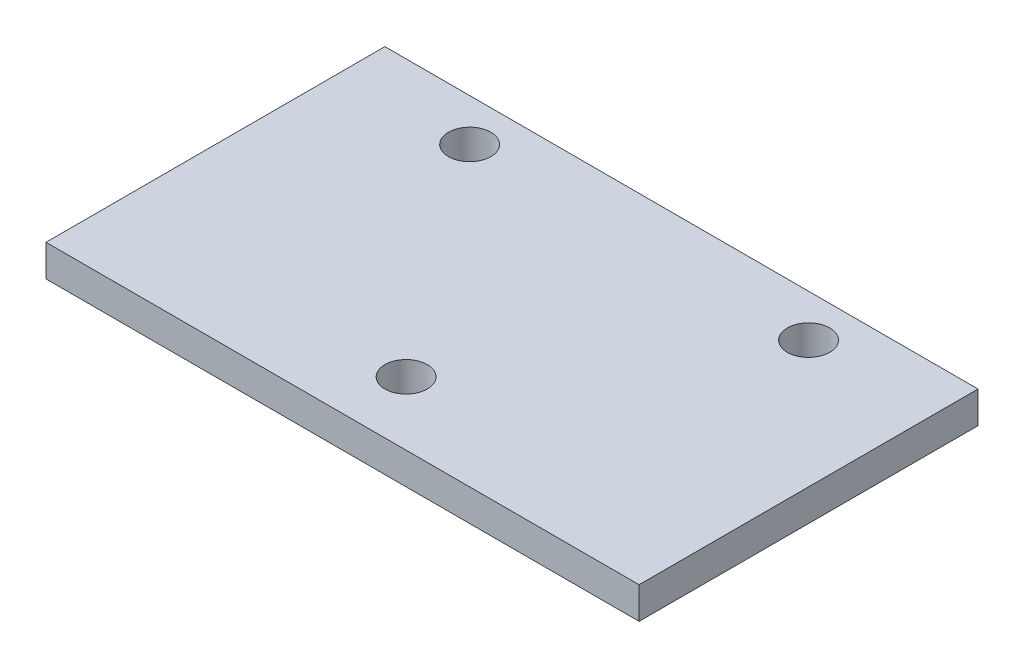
from build123d import *

# Parameters (mm, degrees)
SKETCH1_W   = 177.8
SKETCH1_H   = 101.6
PLATE_DEPTH = 9.525
SKETCH2_R   = 6.35
HOLES_DEPTH = 103.832755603


with BuildPart() as part:
    # Sketch1 → Plate (new body)
    with BuildSketch(Plane(origin=(0, 0, 0), x_dir=(1, 0, 0), z_dir=(0, 1, 0))):
        Rectangle(SKETCH1_W, SKETCH1_H)
    extrude(amount=PLATE_DEPTH)

    # Sketch2 → Holes (cut, through all)
    with BuildSketch(Plane(origin=(0, 9.525, 0), x_dir=(-1, 0, 0), z_dir=(0, 1, 0))):
        with Locations(Location((50.8, -38.1, 0), (0, 0, 90))):
            Circle(SKETCH2_R)
        with Locations(Location((-50.8, -38.1, 0), (0, 0, 90))):
            Circle(SKETCH2_R)
        with Locations(Location((0, 31.75, 0), (0, 0, 90))):
            Circle(SKETCH2_R)
    extrude(amount=-HOLES_DEPTH, mode=Mode.SUBTRACT)


solid = part.part
